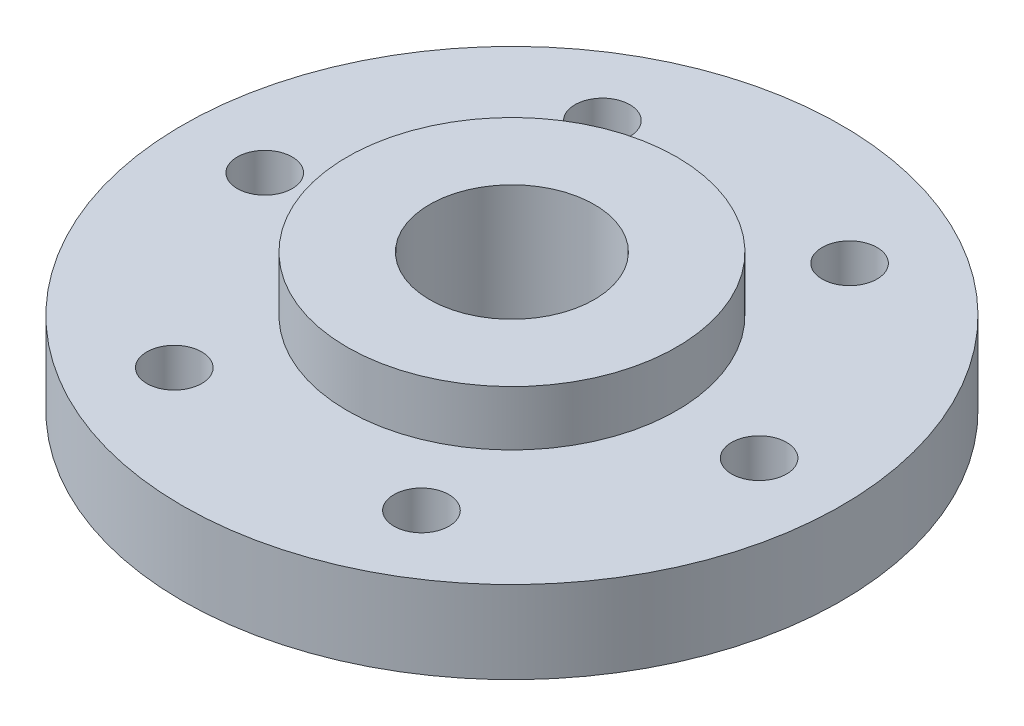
ISO-10303-21;
HEADER;
FILE_DESCRIPTION(('STEP AP214'),'2;1');
FILE_NAME('part.step','',(''),(''),'','','');
FILE_SCHEMA(('AUTOMOTIVE_DESIGN { 1 0 10303 214 1 1 1 1 }'));
ENDSEC;
DATA;
#1=APPLICATION_CONTEXT('core data for automotive mechanical design processes');
#2=APPLICATION_PROTOCOL_DEFINITION('international standard','automotive_design',2000,#1);
#3=PRODUCT_CONTEXT('',#1,'mechanical');
#4=PRODUCT('Part','Part','',(#3));
#5=PRODUCT_RELATED_PRODUCT_CATEGORY('part','',(#4));
#6=PRODUCT_DEFINITION_FORMATION('','',#4);
#7=PRODUCT_DEFINITION_CONTEXT('part definition',#1,'design');
#8=PRODUCT_DEFINITION('design','',#6,#7);
#9=PRODUCT_DEFINITION_SHAPE('','',#8);
#10=(LENGTH_UNIT() NAMED_UNIT(*) SI_UNIT(.MILLI.,.METRE.));
#11=(NAMED_UNIT(*) PLANE_ANGLE_UNIT() SI_UNIT($,.RADIAN.));
#12=(NAMED_UNIT(*) SI_UNIT($,.STERADIAN.) SOLID_ANGLE_UNIT());
#13=UNCERTAINTY_MEASURE_WITH_UNIT(LENGTH_MEASURE(1.E-05),#10,'distance_accuracy_value','');
#14=(GEOMETRIC_REPRESENTATION_CONTEXT(3) GLOBAL_UNCERTAINTY_ASSIGNED_CONTEXT((#13)) GLOBAL_UNIT_ASSIGNED_CONTEXT((#10,
#11,#12)) REPRESENTATION_CONTEXT('',''));
#15=CARTESIAN_POINT('',(0.,0.,0.));
#16=DIRECTION('',(0.,0.,1.));
#17=DIRECTION('',(1.,0.,0.));
#18=AXIS2_PLACEMENT_3D('',#15,#16,#17);
#19=CARTESIAN_POINT('',(0.,15.,0.));
#20=DIRECTION('',(0.,-1.,0.));
#21=DIRECTION('',(0.,0.,-1.));
#22=AXIS2_PLACEMENT_3D('',#19,#20,#21);
#23=CYLINDRICAL_SURFACE('',#22,60.);
#24=CARTESIAN_POINT('',(0.,15.,0.));
#25=DIRECTION('',(0.,1.,0.));
#26=DIRECTION('',(0.,0.,1.));
#27=AXIS2_PLACEMENT_3D('',#24,#25,#26);
#28=CIRCLE('',#27,60.);
#29=CARTESIAN_POINT('',(0.,15.,60.));
#30=VERTEX_POINT('',#29);
#31=EDGE_CURVE('E46',#30,#30,#28,.T.);
#32=ORIENTED_EDGE('',*,*,#31,.F.);
#33=EDGE_LOOP('',(#32));
#34=FACE_BOUND('',#33,.T.);
#35=CARTESIAN_POINT('',(0.,0.,0.));
#36=DIRECTION('',(0.,1.,0.));
#37=DIRECTION('',(0.,0.,1.));
#38=AXIS2_PLACEMENT_3D('',#35,#36,#37);
#39=CIRCLE('',#38,60.);
#40=CARTESIAN_POINT('',(0.,0.,60.));
#41=VERTEX_POINT('',#40);
#42=EDGE_CURVE('E51',#41,#41,#39,.T.);
#43=ORIENTED_EDGE('',*,*,#42,.T.);
#44=EDGE_LOOP('',(#43));
#45=FACE_BOUND('',#44,.T.);
#46=ADVANCED_FACE('F39',(#34,#45),#23,.T.);
#47=CARTESIAN_POINT('',(0.,15.,0.));
#48=DIRECTION('',(0.,1.,0.));
#49=DIRECTION('',(0.,0.,1.));
#50=AXIS2_PLACEMENT_3D('',#47,#48,#49);
#51=PLANE('',#50);
#52=CARTESIAN_POINT('',(45.,15.,0.));
#53=DIRECTION('',(0.,1.,0.));
#54=DIRECTION('',(0.,0.,1.));
#55=AXIS2_PLACEMENT_3D('',#52,#53,#54);
#56=CIRCLE('',#55,5.);
#57=CARTESIAN_POINT('',(45.,15.,5.));
#58=VERTEX_POINT('',#57);
#59=EDGE_CURVE('E70',#58,#58,#56,.F.);
#60=ORIENTED_EDGE('',*,*,#59,.T.);
#61=EDGE_LOOP('',(#60));
#62=FACE_BOUND('',#61,.T.);
#63=CARTESIAN_POINT('',(22.5,15.,38.9711431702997));
#64=DIRECTION('',(0.,1.,0.));
#65=DIRECTION('',(0.,0.,1.));
#66=AXIS2_PLACEMENT_3D('',#63,#64,#65);
#67=CIRCLE('',#66,5.);
#68=CARTESIAN_POINT('',(22.5,15.,43.9711431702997));
#69=VERTEX_POINT('',#68);
#70=EDGE_CURVE('E72',#69,#69,#67,.F.);
#71=ORIENTED_EDGE('',*,*,#70,.T.);
#72=EDGE_LOOP('',(#71));
#73=FACE_BOUND('',#72,.T.);
#74=CARTESIAN_POINT('',(-22.5,15.,38.9711431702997));
#75=DIRECTION('',(0.,1.,0.));
#76=DIRECTION('',(0.,0.,1.));
#77=AXIS2_PLACEMENT_3D('',#74,#75,#76);
#78=CIRCLE('',#77,4.99999999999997);
#79=CARTESIAN_POINT('',(-22.5,15.,43.9711431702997));
#80=VERTEX_POINT('',#79);
#81=EDGE_CURVE('E76',#80,#80,#78,.F.);
#82=ORIENTED_EDGE('',*,*,#81,.T.);
#83=EDGE_LOOP('',(#82));
#84=FACE_BOUND('',#83,.T.);
#85=CARTESIAN_POINT('',(-45.,15.,0.));
#86=DIRECTION('',(0.,1.,0.));
#87=DIRECTION('',(0.,0.,1.));
#88=AXIS2_PLACEMENT_3D('',#85,#86,#87);
#89=CIRCLE('',#88,5.);
#90=CARTESIAN_POINT('',(-45.,15.,5.));
#91=VERTEX_POINT('',#90);
#92=EDGE_CURVE('E78',#91,#91,#89,.F.);
#93=ORIENTED_EDGE('',*,*,#92,.T.);
#94=EDGE_LOOP('',(#93));
#95=FACE_BOUND('',#94,.T.);
#96=CARTESIAN_POINT('',(-22.5,15.,-38.9711431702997));
#97=DIRECTION('',(0.,1.,0.));
#98=DIRECTION('',(0.,0.,1.));
#99=AXIS2_PLACEMENT_3D('',#96,#97,#98);
#100=CIRCLE('',#99,5.);
#101=CARTESIAN_POINT('',(-22.5,15.,-33.9711431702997));
#102=VERTEX_POINT('',#101);
#103=EDGE_CURVE('E85',#102,#102,#100,.F.);
#104=ORIENTED_EDGE('',*,*,#103,.T.);
#105=EDGE_LOOP('',(#104));
#106=FACE_BOUND('',#105,.T.);
#107=CARTESIAN_POINT('',(22.5,15.,-38.9711431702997));
#108=DIRECTION('',(0.,1.,0.));
#109=DIRECTION('',(0.,0.,1.));
#110=AXIS2_PLACEMENT_3D('',#107,#108,#109);
#111=CIRCLE('',#110,5.);
#112=CARTESIAN_POINT('',(22.5,15.,-33.9711431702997));
#113=VERTEX_POINT('',#112);
#114=EDGE_CURVE('E81',#113,#113,#111,.F.);
#115=ORIENTED_EDGE('',*,*,#114,.T.);
#116=EDGE_LOOP('',(#115));
#117=FACE_BOUND('',#116,.T.);
#118=CARTESIAN_POINT('',(0.,15.,0.));
#119=DIRECTION('',(0.,1.,0.));
#120=DIRECTION('',(0.,0.,1.));
#121=AXIS2_PLACEMENT_3D('',#118,#119,#120);
#122=CIRCLE('',#121,30.);
#123=CARTESIAN_POINT('',(0.,15.,30.));
#124=VERTEX_POINT('',#123);
#125=EDGE_CURVE('E10',#124,#124,#122,.T.);
#126=ORIENTED_EDGE('',*,*,#125,.F.);
#127=EDGE_LOOP('',(#126));
#128=FACE_BOUND('',#127,.T.);
#129=ORIENTED_EDGE('',*,*,#31,.T.);
#130=EDGE_LOOP('',(#129));
#131=FACE_BOUND('',#130,.T.);
#132=ADVANCED_FACE('F123',(#62,#73,#84,#95,#106,#117,#128,#131),#51,.T.);
#133=CARTESIAN_POINT('',(0.,0.,0.));
#134=DIRECTION('',(0.,1.,0.));
#135=DIRECTION('',(0.,0.,1.));
#136=AXIS2_PLACEMENT_3D('',#133,#134,#135);
#137=PLANE('',#136);
#138=CARTESIAN_POINT('',(45.,0.,0.));
#139=DIRECTION('',(0.,1.,0.));
#140=DIRECTION('',(0.,0.,1.));
#141=AXIS2_PLACEMENT_3D('',#138,#139,#140);
#142=CIRCLE('',#141,5.);
#143=CARTESIAN_POINT('',(45.,0.,5.));
#144=VERTEX_POINT('',#143);
#145=EDGE_CURVE('E86',#144,#144,#142,.T.);
#146=ORIENTED_EDGE('',*,*,#145,.T.);
#147=EDGE_LOOP('',(#146));
#148=FACE_BOUND('',#147,.T.);
#149=CARTESIAN_POINT('',(22.5,0.,38.9711431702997));
#150=DIRECTION('',(0.,1.,0.));
#151=DIRECTION('',(0.,0.,1.));
#152=AXIS2_PLACEMENT_3D('',#149,#150,#151);
#153=CIRCLE('',#152,5.);
#154=CARTESIAN_POINT('',(22.5,0.,43.9711431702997));
#155=VERTEX_POINT('',#154);
#156=EDGE_CURVE('E91',#155,#155,#153,.T.);
#157=ORIENTED_EDGE('',*,*,#156,.T.);
#158=EDGE_LOOP('',(#157));
#159=FACE_BOUND('',#158,.T.);
#160=CARTESIAN_POINT('',(-22.5,0.,38.9711431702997));
#161=DIRECTION('',(0.,1.,0.));
#162=DIRECTION('',(0.,0.,1.));
#163=AXIS2_PLACEMENT_3D('',#160,#161,#162);
#164=CIRCLE('',#163,4.99999999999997);
#165=CARTESIAN_POINT('',(-22.5,0.,43.9711431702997));
#166=VERTEX_POINT('',#165);
#167=EDGE_CURVE('E90',#166,#166,#164,.T.);
#168=ORIENTED_EDGE('',*,*,#167,.T.);
#169=EDGE_LOOP('',(#168));
#170=FACE_BOUND('',#169,.T.);
#171=CARTESIAN_POINT('',(-45.,0.,0.));
#172=DIRECTION('',(0.,1.,0.));
#173=DIRECTION('',(0.,0.,1.));
#174=AXIS2_PLACEMENT_3D('',#171,#172,#173);
#175=CIRCLE('',#174,5.);
#176=CARTESIAN_POINT('',(-45.,0.,5.));
#177=VERTEX_POINT('',#176);
#178=EDGE_CURVE('E95',#177,#177,#175,.T.);
#179=ORIENTED_EDGE('',*,*,#178,.T.);
#180=EDGE_LOOP('',(#179));
#181=FACE_BOUND('',#180,.T.);
#182=CARTESIAN_POINT('',(-22.5,0.,-38.9711431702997));
#183=DIRECTION('',(0.,1.,0.));
#184=DIRECTION('',(0.,0.,1.));
#185=AXIS2_PLACEMENT_3D('',#182,#183,#184);
#186=CIRCLE('',#185,5.);
#187=CARTESIAN_POINT('',(-22.5,0.,-33.9711431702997));
#188=VERTEX_POINT('',#187);
#189=EDGE_CURVE('E96',#188,#188,#186,.T.);
#190=ORIENTED_EDGE('',*,*,#189,.T.);
#191=EDGE_LOOP('',(#190));
#192=FACE_BOUND('',#191,.T.);
#193=CARTESIAN_POINT('',(22.5,0.,-38.9711431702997));
#194=DIRECTION('',(0.,1.,0.));
#195=DIRECTION('',(0.,0.,1.));
#196=AXIS2_PLACEMENT_3D('',#193,#194,#195);
#197=CIRCLE('',#196,5.);
#198=CARTESIAN_POINT('',(22.5,0.,-33.9711431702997));
#199=VERTEX_POINT('',#198);
#200=EDGE_CURVE('E97',#199,#199,#197,.T.);
#201=ORIENTED_EDGE('',*,*,#200,.T.);
#202=EDGE_LOOP('',(#201));
#203=FACE_BOUND('',#202,.T.);
#204=CARTESIAN_POINT('',(0.,0.,0.));
#205=DIRECTION('',(0.,1.,0.));
#206=DIRECTION('',(0.,0.,1.));
#207=AXIS2_PLACEMENT_3D('',#204,#205,#206);
#208=CIRCLE('',#207,15.);
#209=CARTESIAN_POINT('',(0.,0.,15.));
#210=VERTEX_POINT('',#209);
#211=EDGE_CURVE('E64',#210,#210,#208,.T.);
#212=ORIENTED_EDGE('',*,*,#211,.T.);
#213=EDGE_LOOP('',(#212));
#214=FACE_BOUND('',#213,.T.);
#215=ORIENTED_EDGE('',*,*,#42,.F.);
#216=EDGE_LOOP('',(#215));
#217=FACE_BOUND('',#216,.T.);
#218=ADVANCED_FACE('F110',(#148,#159,#170,#181,#192,#203,#214,#217),#137,.F.);
#219=CARTESIAN_POINT('',(0.,25.,0.));
#220=DIRECTION('',(0.,-1.,0.));
#221=DIRECTION('',(0.,0.,-1.));
#222=AXIS2_PLACEMENT_3D('',#219,#220,#221);
#223=CYLINDRICAL_SURFACE('',#222,30.);
#224=CARTESIAN_POINT('',(0.,25.,0.));
#225=DIRECTION('',(0.,1.,0.));
#226=DIRECTION('',(0.,0.,1.));
#227=AXIS2_PLACEMENT_3D('',#224,#225,#226);
#228=CIRCLE('',#227,30.);
#229=CARTESIAN_POINT('',(0.,25.,30.));
#230=VERTEX_POINT('',#229);
#231=EDGE_CURVE('E53',#230,#230,#228,.T.);
#232=ORIENTED_EDGE('',*,*,#231,.F.);
#233=EDGE_LOOP('',(#232));
#234=FACE_BOUND('',#233,.T.);
#235=ORIENTED_EDGE('',*,*,#125,.T.);
#236=EDGE_LOOP('',(#235));
#237=FACE_BOUND('',#236,.T.);
#238=ADVANCED_FACE('F140',(#234,#237),#223,.T.);
#239=CARTESIAN_POINT('',(0.,25.,0.));
#240=DIRECTION('',(0.,1.,0.));
#241=DIRECTION('',(0.,0.,1.));
#242=AXIS2_PLACEMENT_3D('',#239,#240,#241);
#243=PLANE('',#242);
#244=CARTESIAN_POINT('',(0.,25.,0.));
#245=DIRECTION('',(0.,1.,0.));
#246=DIRECTION('',(0.,0.,1.));
#247=AXIS2_PLACEMENT_3D('',#244,#245,#246);
#248=CIRCLE('',#247,15.);
#249=CARTESIAN_POINT('',(0.,25.,15.));
#250=VERTEX_POINT('',#249);
#251=EDGE_CURVE('E45',#250,#250,#248,.F.);
#252=ORIENTED_EDGE('',*,*,#251,.T.);
#253=EDGE_LOOP('',(#252));
#254=FACE_BOUND('',#253,.T.);
#255=ORIENTED_EDGE('',*,*,#231,.T.);
#256=EDGE_LOOP('',(#255));
#257=FACE_BOUND('',#256,.T.);
#258=ADVANCED_FACE('F143',(#254,#257),#243,.T.);
#259=CARTESIAN_POINT('',(0.,30.,0.));
#260=DIRECTION('',(0.,-1.,0.));
#261=DIRECTION('',(0.,0.,-1.));
#262=AXIS2_PLACEMENT_3D('',#259,#260,#261);
#263=CYLINDRICAL_SURFACE('',#262,15.);
#264=ORIENTED_EDGE('',*,*,#251,.F.);
#265=EDGE_LOOP('',(#264));
#266=FACE_BOUND('',#265,.T.);
#267=ORIENTED_EDGE('',*,*,#211,.F.);
#268=EDGE_LOOP('',(#267));
#269=FACE_BOUND('',#268,.T.);
#270=ADVANCED_FACE('F144',(#266,#269),#263,.F.);
#271=CARTESIAN_POINT('',(22.5,20.,-38.9711431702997));
#272=DIRECTION('',(0.,-1.,0.));
#273=DIRECTION('',(0.,0.,-1.));
#274=AXIS2_PLACEMENT_3D('',#271,#272,#273);
#275=CYLINDRICAL_SURFACE('',#274,5.);
#276=ORIENTED_EDGE('',*,*,#114,.F.);
#277=EDGE_LOOP('',(#276));
#278=FACE_BOUND('',#277,.T.);
#279=ORIENTED_EDGE('',*,*,#200,.F.);
#280=EDGE_LOOP('',(#279));
#281=FACE_BOUND('',#280,.T.);
#282=ADVANCED_FACE('F150',(#278,#281),#275,.F.);
#283=CARTESIAN_POINT('',(-22.5,20.,-38.9711431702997));
#284=DIRECTION('',(0.,-1.,0.));
#285=DIRECTION('',(0.,0.,-1.));
#286=AXIS2_PLACEMENT_3D('',#283,#284,#285);
#287=CYLINDRICAL_SURFACE('',#286,5.);
#288=ORIENTED_EDGE('',*,*,#103,.F.);
#289=EDGE_LOOP('',(#288));
#290=FACE_BOUND('',#289,.T.);
#291=ORIENTED_EDGE('',*,*,#189,.F.);
#292=EDGE_LOOP('',(#291));
#293=FACE_BOUND('',#292,.T.);
#294=ADVANCED_FACE('F154',(#290,#293),#287,.F.);
#295=CARTESIAN_POINT('',(-45.,20.,0.));
#296=DIRECTION('',(0.,-1.,0.));
#297=DIRECTION('',(0.,0.,-1.));
#298=AXIS2_PLACEMENT_3D('',#295,#296,#297);
#299=CYLINDRICAL_SURFACE('',#298,5.);
#300=ORIENTED_EDGE('',*,*,#92,.F.);
#301=EDGE_LOOP('',(#300));
#302=FACE_BOUND('',#301,.T.);
#303=ORIENTED_EDGE('',*,*,#178,.F.);
#304=EDGE_LOOP('',(#303));
#305=FACE_BOUND('',#304,.T.);
#306=ADVANCED_FACE('F151',(#302,#305),#299,.F.);
#307=CARTESIAN_POINT('',(-22.5,20.,38.9711431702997));
#308=DIRECTION('',(0.,-1.,0.));
#309=DIRECTION('',(0.,0.,-1.));
#310=AXIS2_PLACEMENT_3D('',#307,#308,#309);
#311=CYLINDRICAL_SURFACE('',#310,4.99999999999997);
#312=ORIENTED_EDGE('',*,*,#81,.F.);
#313=EDGE_LOOP('',(#312));
#314=FACE_BOUND('',#313,.T.);
#315=ORIENTED_EDGE('',*,*,#167,.F.);
#316=EDGE_LOOP('',(#315));
#317=FACE_BOUND('',#316,.T.);
#318=ADVANCED_FACE('F119',(#314,#317),#311,.F.);
#319=CARTESIAN_POINT('',(22.5,20.,38.9711431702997));
#320=DIRECTION('',(0.,-1.,0.));
#321=DIRECTION('',(0.,0.,-1.));
#322=AXIS2_PLACEMENT_3D('',#319,#320,#321);
#323=CYLINDRICAL_SURFACE('',#322,5.);
#324=ORIENTED_EDGE('',*,*,#70,.F.);
#325=EDGE_LOOP('',(#324));
#326=FACE_BOUND('',#325,.T.);
#327=ORIENTED_EDGE('',*,*,#156,.F.);
#328=EDGE_LOOP('',(#327));
#329=FACE_BOUND('',#328,.T.);
#330=ADVANCED_FACE('F115',(#326,#329),#323,.F.);
#331=CARTESIAN_POINT('',(45.,20.,0.));
#332=DIRECTION('',(0.,-1.,0.));
#333=DIRECTION('',(0.,0.,-1.));
#334=AXIS2_PLACEMENT_3D('',#331,#332,#333);
#335=CYLINDRICAL_SURFACE('',#334,5.);
#336=ORIENTED_EDGE('',*,*,#59,.F.);
#337=EDGE_LOOP('',(#336));
#338=FACE_BOUND('',#337,.T.);
#339=ORIENTED_EDGE('',*,*,#145,.F.);
#340=EDGE_LOOP('',(#339));
#341=FACE_BOUND('',#340,.T.);
#342=ADVANCED_FACE('F109',(#338,#341),#335,.F.);
#343=CLOSED_SHELL('',(#46,#132,#218,#238,#258,#270,#282,#294,#306,#318,#330,#342));
#344=MANIFOLD_SOLID_BREP('B2',#343);
#345=ADVANCED_BREP_SHAPE_REPRESENTATION('',(#18,#344),#14);
#346=SHAPE_DEFINITION_REPRESENTATION(#9,#345);
ENDSEC;
END-ISO-10303-21;
